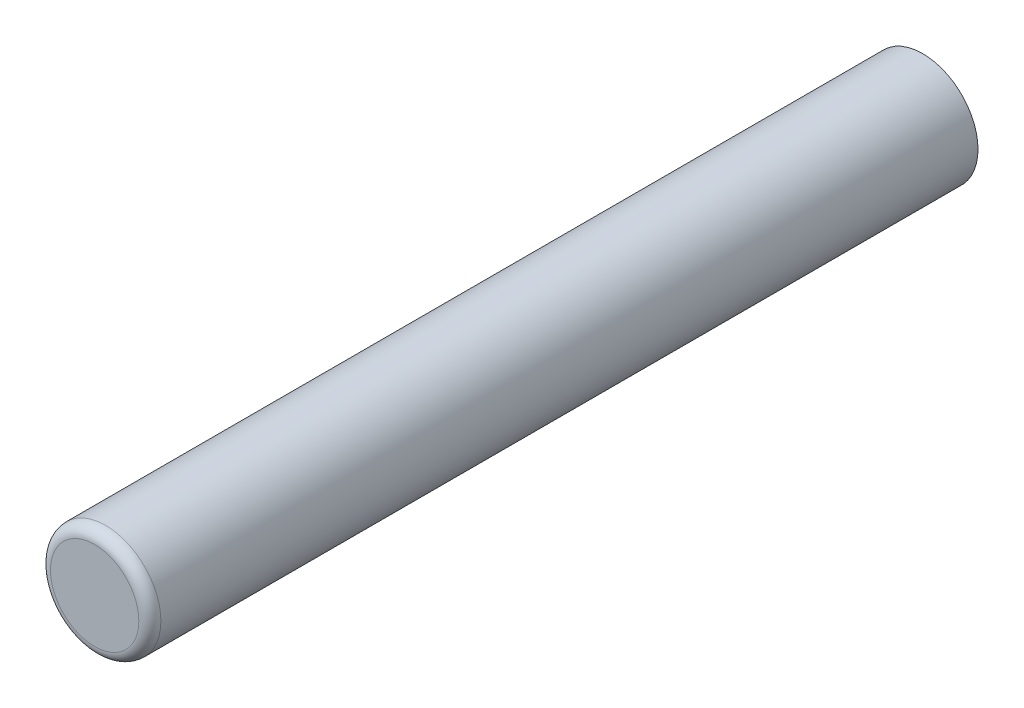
from build123d import *

# Parameters (mm, degrees)
SKETCH1_R      = 0.508
EXTRUDE1_DEPTH = 7.62
FILLET1_R      = 0.1016


with BuildPart() as part:
    # Sketch1 → Extrude1 (new body)
    with BuildSketch(Plane.XY):
        Circle(SKETCH1_R)
    extrude(amount=EXTRUDE1_DEPTH)

    # Fillet1
    fillet1_edges = [part.edges().sort_by_distance(p)[0] for p in [
        (-0.508, 0, 7.62),
    ]]
    fillet(fillet1_edges, radius=FILLET1_R)


solid = part.part
